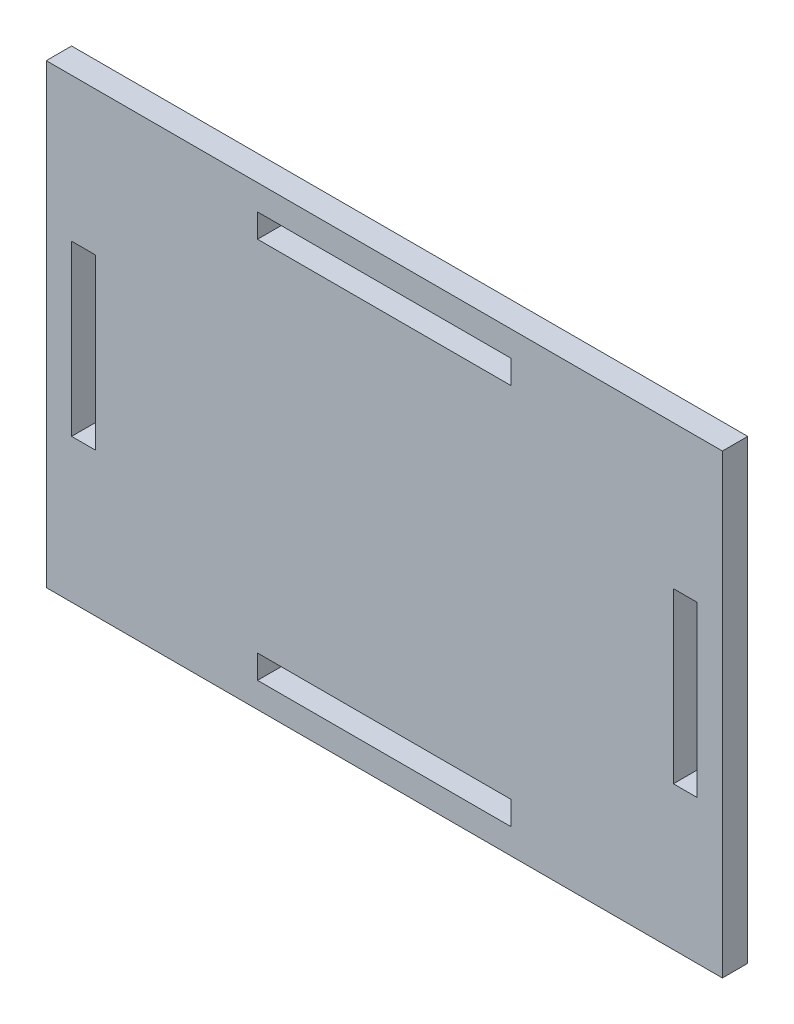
ISO-10303-21;
HEADER;
FILE_DESCRIPTION(('STEP AP214'),'2;1');
FILE_NAME('part.step','',(''),(''),'','','');
FILE_SCHEMA(('AUTOMOTIVE_DESIGN { 1 0 10303 214 1 1 1 1 }'));
ENDSEC;
DATA;
#1=APPLICATION_CONTEXT('core data for automotive mechanical design processes');
#2=APPLICATION_PROTOCOL_DEFINITION('international standard','automotive_design',2000,#1);
#3=PRODUCT_CONTEXT('',#1,'mechanical');
#4=PRODUCT('Part','Part','',(#3));
#5=PRODUCT_RELATED_PRODUCT_CATEGORY('part','',(#4));
#6=PRODUCT_DEFINITION_FORMATION('','',#4);
#7=PRODUCT_DEFINITION_CONTEXT('part definition',#1,'design');
#8=PRODUCT_DEFINITION('design','',#6,#7);
#9=PRODUCT_DEFINITION_SHAPE('','',#8);
#10=(LENGTH_UNIT() NAMED_UNIT(*) SI_UNIT(.MILLI.,.METRE.));
#11=(NAMED_UNIT(*) PLANE_ANGLE_UNIT() SI_UNIT($,.RADIAN.));
#12=(NAMED_UNIT(*) SI_UNIT($,.STERADIAN.) SOLID_ANGLE_UNIT());
#13=UNCERTAINTY_MEASURE_WITH_UNIT(LENGTH_MEASURE(1.E-05),#10,'distance_accuracy_value','');
#14=(GEOMETRIC_REPRESENTATION_CONTEXT(3) GLOBAL_UNCERTAINTY_ASSIGNED_CONTEXT((#13)) GLOBAL_UNIT_ASSIGNED_CONTEXT((#10,
#11,#12)) REPRESENTATION_CONTEXT('',''));
#15=CARTESIAN_POINT('',(0.,0.,0.));
#16=DIRECTION('',(0.,0.,1.));
#17=DIRECTION('',(1.,0.,0.));
#18=AXIS2_PLACEMENT_3D('',#15,#16,#17);
#19=CARTESIAN_POINT('',(0.,0.,3.));
#20=DIRECTION('',(0.,0.,-1.));
#21=DIRECTION('',(-1.,0.,0.));
#22=AXIS2_PLACEMENT_3D('',#19,#20,#21);
#23=PLANE('',#22);
#24=DIRECTION('',(0.,-1.,0.));
#25=VECTOR('',#24,1.);
#26=CARTESIAN_POINT('',(-15.,-24.,3.));
#27=LINE('',#26,#25);
#28=CARTESIAN_POINT('',(-15.,-21.2,3.));
#29=VERTEX_POINT('',#28);
#30=CARTESIAN_POINT('',(-15.,-24.,3.));
#31=VERTEX_POINT('',#30);
#32=EDGE_CURVE('E206',#29,#31,#27,.T.);
#33=ORIENTED_EDGE('',*,*,#32,.F.);
#34=DIRECTION('',(-1.,0.,0.));
#35=VECTOR('',#34,1.);
#36=CARTESIAN_POINT('',(-15.,-21.2,3.));
#37=LINE('',#36,#35);
#38=CARTESIAN_POINT('',(15.,-21.2,3.));
#39=VERTEX_POINT('',#38);
#40=EDGE_CURVE('E214',#39,#29,#37,.T.);
#41=ORIENTED_EDGE('',*,*,#40,.F.);
#42=DIRECTION('',(0.,1.,0.));
#43=VECTOR('',#42,1.);
#44=CARTESIAN_POINT('',(15.,-24.,3.));
#45=LINE('',#44,#43);
#46=CARTESIAN_POINT('',(15.,-24.,3.));
#47=VERTEX_POINT('',#46);
#48=EDGE_CURVE('E211',#47,#39,#45,.T.);
#49=ORIENTED_EDGE('',*,*,#48,.F.);
#50=DIRECTION('',(1.,0.,0.));
#51=VECTOR('',#50,1.);
#52=CARTESIAN_POINT('',(-15.,-24.,3.));
#53=LINE('',#52,#51);
#54=EDGE_CURVE('E208',#31,#47,#53,.T.);
#55=ORIENTED_EDGE('',*,*,#54,.F.);
#56=EDGE_LOOP('',(#33,#41,#49,#55));
#57=FACE_BOUND('',#56,.T.);
#58=DIRECTION('',(0.,1.,0.));
#59=VECTOR('',#58,1.);
#60=CARTESIAN_POINT('',(15.,24.,3.));
#61=LINE('',#60,#59);
#62=CARTESIAN_POINT('',(15.,21.2,3.));
#63=VERTEX_POINT('',#62);
#64=CARTESIAN_POINT('',(15.,24.,3.));
#65=VERTEX_POINT('',#64);
#66=EDGE_CURVE('E268',#63,#65,#61,.T.);
#67=ORIENTED_EDGE('',*,*,#66,.F.);
#68=DIRECTION('',(1.,0.,0.));
#69=VECTOR('',#68,1.);
#70=CARTESIAN_POINT('',(-15.,21.2,3.));
#71=LINE('',#70,#69);
#72=CARTESIAN_POINT('',(-15.,21.2,3.));
#73=VERTEX_POINT('',#72);
#74=EDGE_CURVE('E276',#73,#63,#71,.T.);
#75=ORIENTED_EDGE('',*,*,#74,.F.);
#76=DIRECTION('',(0.,-1.,0.));
#77=VECTOR('',#76,1.);
#78=CARTESIAN_POINT('',(-15.,24.,3.));
#79=LINE('',#78,#77);
#80=CARTESIAN_POINT('',(-15.,24.,3.));
#81=VERTEX_POINT('',#80);
#82=EDGE_CURVE('E273',#81,#73,#79,.T.);
#83=ORIENTED_EDGE('',*,*,#82,.F.);
#84=DIRECTION('',(-1.,0.,0.));
#85=VECTOR('',#84,1.);
#86=CARTESIAN_POINT('',(-15.,24.,3.));
#87=LINE('',#86,#85);
#88=EDGE_CURVE('E270',#65,#81,#87,.T.);
#89=ORIENTED_EDGE('',*,*,#88,.F.);
#90=EDGE_LOOP('',(#67,#75,#83,#89));
#91=FACE_BOUND('',#90,.T.);
#92=DIRECTION('',(0.,1.,0.));
#93=VECTOR('',#92,1.);
#94=CARTESIAN_POINT('',(40.,-27.,3.));
#95=LINE('',#94,#93);
#96=CARTESIAN_POINT('',(40.,-27.,3.));
#97=VERTEX_POINT('',#96);
#98=CARTESIAN_POINT('',(40.,27.,3.));
#99=VERTEX_POINT('',#98);
#100=EDGE_CURVE('E299',#97,#99,#95,.T.);
#101=ORIENTED_EDGE('',*,*,#100,.T.);
#102=DIRECTION('',(-1.,0.,0.));
#103=VECTOR('',#102,1.);
#104=CARTESIAN_POINT('',(-40.,27.,3.));
#105=LINE('',#104,#103);
#106=CARTESIAN_POINT('',(-40.,27.,3.));
#107=VERTEX_POINT('',#106);
#108=EDGE_CURVE('E302',#99,#107,#105,.T.);
#109=ORIENTED_EDGE('',*,*,#108,.T.);
#110=DIRECTION('',(0.,-1.,0.));
#111=VECTOR('',#110,1.);
#112=CARTESIAN_POINT('',(-40.,-27.,3.));
#113=LINE('',#112,#111);
#114=CARTESIAN_POINT('',(-40.,-27.,3.));
#115=VERTEX_POINT('',#114);
#116=EDGE_CURVE('E305',#107,#115,#113,.T.);
#117=ORIENTED_EDGE('',*,*,#116,.T.);
#118=DIRECTION('',(1.,0.,0.));
#119=VECTOR('',#118,1.);
#120=CARTESIAN_POINT('',(-40.,-27.,3.));
#121=LINE('',#120,#119);
#122=EDGE_CURVE('E307',#115,#97,#121,.T.);
#123=ORIENTED_EDGE('',*,*,#122,.T.);
#124=EDGE_LOOP('',(#101,#109,#117,#123));
#125=FACE_BOUND('',#124,.T.);
#126=DIRECTION('',(0.,1.,0.));
#127=VECTOR('',#126,1.);
#128=CARTESIAN_POINT('',(-34.2,-10.,3.));
#129=LINE('',#128,#127);
#130=CARTESIAN_POINT('',(-34.2,-10.,3.));
#131=VERTEX_POINT('',#130);
#132=CARTESIAN_POINT('',(-34.2,10.,3.));
#133=VERTEX_POINT('',#132);
#134=EDGE_CURVE('E237',#131,#133,#129,.T.);
#135=ORIENTED_EDGE('',*,*,#134,.F.);
#136=DIRECTION('',(1.,0.,0.));
#137=VECTOR('',#136,1.);
#138=CARTESIAN_POINT('',(-37.,-10.,3.));
#139=LINE('',#138,#137);
#140=CARTESIAN_POINT('',(-37.,-10.,3.));
#141=VERTEX_POINT('',#140);
#142=EDGE_CURVE('E245',#141,#131,#139,.T.);
#143=ORIENTED_EDGE('',*,*,#142,.F.);
#144=DIRECTION('',(0.,-1.,0.));
#145=VECTOR('',#144,1.);
#146=CARTESIAN_POINT('',(-37.,-10.,3.));
#147=LINE('',#146,#145);
#148=CARTESIAN_POINT('',(-37.,10.,3.));
#149=VERTEX_POINT('',#148);
#150=EDGE_CURVE('E242',#149,#141,#147,.T.);
#151=ORIENTED_EDGE('',*,*,#150,.F.);
#152=DIRECTION('',(-1.,0.,0.));
#153=VECTOR('',#152,1.);
#154=CARTESIAN_POINT('',(-37.,10.,3.));
#155=LINE('',#154,#153);
#156=EDGE_CURVE('E239',#133,#149,#155,.T.);
#157=ORIENTED_EDGE('',*,*,#156,.F.);
#158=EDGE_LOOP('',(#135,#143,#151,#157));
#159=FACE_BOUND('',#158,.T.);
#160=DIRECTION('',(0.,1.,0.));
#161=VECTOR('',#160,1.);
#162=CARTESIAN_POINT('',(37.,-9.99999999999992,3.));
#163=LINE('',#162,#161);
#164=CARTESIAN_POINT('',(37.,-9.99999999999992,3.));
#165=VERTEX_POINT('',#164);
#166=CARTESIAN_POINT('',(37.,10.0000000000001,3.));
#167=VERTEX_POINT('',#166);
#168=EDGE_CURVE('E170',#165,#167,#163,.T.);
#169=ORIENTED_EDGE('',*,*,#168,.F.);
#170=DIRECTION('',(1.,0.,0.));
#171=VECTOR('',#170,1.);
#172=CARTESIAN_POINT('',(37.,-9.99999999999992,3.));
#173=LINE('',#172,#171);
#174=CARTESIAN_POINT('',(34.2,-9.99999999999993,3.));
#175=VERTEX_POINT('',#174);
#176=EDGE_CURVE('E192',#175,#165,#173,.T.);
#177=ORIENTED_EDGE('',*,*,#176,.F.);
#178=DIRECTION('',(0.,-1.,0.));
#179=VECTOR('',#178,1.);
#180=CARTESIAN_POINT('',(34.2,-9.99999999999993,3.));
#181=LINE('',#180,#179);
#182=CARTESIAN_POINT('',(34.2,10.0000000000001,3.));
#183=VERTEX_POINT('',#182);
#184=EDGE_CURVE('E190',#183,#175,#181,.T.);
#185=ORIENTED_EDGE('',*,*,#184,.F.);
#186=DIRECTION('',(-1.,0.,0.));
#187=VECTOR('',#186,1.);
#188=CARTESIAN_POINT('',(37.,10.0000000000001,3.));
#189=LINE('',#188,#187);
#190=EDGE_CURVE('E178',#167,#183,#189,.T.);
#191=ORIENTED_EDGE('',*,*,#190,.F.);
#192=EDGE_LOOP('',(#169,#177,#185,#191));
#193=FACE_BOUND('',#192,.T.);
#194=ADVANCED_FACE('F33',(#57,#91,#125,#159,#193),#23,.F.);
#195=CARTESIAN_POINT('',(0.,0.,0.));
#196=DIRECTION('',(0.,0.,-1.));
#197=DIRECTION('',(-1.,0.,0.));
#198=AXIS2_PLACEMENT_3D('',#195,#196,#197);
#199=PLANE('',#198);
#200=DIRECTION('',(0.,1.,0.));
#201=VECTOR('',#200,1.);
#202=CARTESIAN_POINT('',(40.,-27.,0.));
#203=LINE('',#202,#201);
#204=CARTESIAN_POINT('',(40.,-27.,0.));
#205=VERTEX_POINT('',#204);
#206=CARTESIAN_POINT('',(40.,27.,0.));
#207=VERTEX_POINT('',#206);
#208=EDGE_CURVE('E298',#205,#207,#203,.T.);
#209=ORIENTED_EDGE('',*,*,#208,.F.);
#210=DIRECTION('',(1.,0.,0.));
#211=VECTOR('',#210,1.);
#212=CARTESIAN_POINT('',(-40.,-27.,0.));
#213=LINE('',#212,#211);
#214=CARTESIAN_POINT('',(-40.,-27.,0.));
#215=VERTEX_POINT('',#214);
#216=EDGE_CURVE('E303',#215,#205,#213,.T.);
#217=ORIENTED_EDGE('',*,*,#216,.F.);
#218=DIRECTION('',(0.,-1.,0.));
#219=VECTOR('',#218,1.);
#220=CARTESIAN_POINT('',(-40.,-27.,0.));
#221=LINE('',#220,#219);
#222=CARTESIAN_POINT('',(-40.,27.,0.));
#223=VERTEX_POINT('',#222);
#224=EDGE_CURVE('E314',#223,#215,#221,.T.);
#225=ORIENTED_EDGE('',*,*,#224,.F.);
#226=DIRECTION('',(-1.,0.,0.));
#227=VECTOR('',#226,1.);
#228=CARTESIAN_POINT('',(-40.,27.,0.));
#229=LINE('',#228,#227);
#230=EDGE_CURVE('E312',#207,#223,#229,.T.);
#231=ORIENTED_EDGE('',*,*,#230,.F.);
#232=EDGE_LOOP('',(#209,#217,#225,#231));
#233=FACE_BOUND('',#232,.T.);
#234=DIRECTION('',(1.,0.,0.));
#235=VECTOR('',#234,1.);
#236=CARTESIAN_POINT('',(-15.,21.2,0.));
#237=LINE('',#236,#235);
#238=CARTESIAN_POINT('',(-15.,21.2,0.));
#239=VERTEX_POINT('',#238);
#240=CARTESIAN_POINT('',(15.,21.2,0.));
#241=VERTEX_POINT('',#240);
#242=EDGE_CURVE('E271',#239,#241,#237,.T.);
#243=ORIENTED_EDGE('',*,*,#242,.T.);
#244=DIRECTION('',(0.,1.,0.));
#245=VECTOR('',#244,1.);
#246=CARTESIAN_POINT('',(15.,24.,0.));
#247=LINE('',#246,#245);
#248=CARTESIAN_POINT('',(15.,24.,0.));
#249=VERTEX_POINT('',#248);
#250=EDGE_CURVE('E267',#241,#249,#247,.T.);
#251=ORIENTED_EDGE('',*,*,#250,.T.);
#252=DIRECTION('',(-1.,0.,0.));
#253=VECTOR('',#252,1.);
#254=CARTESIAN_POINT('',(-15.,24.,0.));
#255=LINE('',#254,#253);
#256=CARTESIAN_POINT('',(-15.,24.,0.));
#257=VERTEX_POINT('',#256);
#258=EDGE_CURVE('E281',#249,#257,#255,.T.);
#259=ORIENTED_EDGE('',*,*,#258,.T.);
#260=DIRECTION('',(0.,-1.,0.));
#261=VECTOR('',#260,1.);
#262=CARTESIAN_POINT('',(-15.,24.,0.));
#263=LINE('',#262,#261);
#264=EDGE_CURVE('E284',#257,#239,#263,.T.);
#265=ORIENTED_EDGE('',*,*,#264,.T.);
#266=EDGE_LOOP('',(#243,#251,#259,#265));
#267=FACE_BOUND('',#266,.T.);
#268=DIRECTION('',(1.,0.,0.));
#269=VECTOR('',#268,1.);
#270=CARTESIAN_POINT('',(-37.,-10.,0.));
#271=LINE('',#270,#269);
#272=CARTESIAN_POINT('',(-37.,-10.,0.));
#273=VERTEX_POINT('',#272);
#274=CARTESIAN_POINT('',(-34.2,-10.,0.));
#275=VERTEX_POINT('',#274);
#276=EDGE_CURVE('E240',#273,#275,#271,.T.);
#277=ORIENTED_EDGE('',*,*,#276,.T.);
#278=DIRECTION('',(0.,1.,0.));
#279=VECTOR('',#278,1.);
#280=CARTESIAN_POINT('',(-34.2,-10.,0.));
#281=LINE('',#280,#279);
#282=CARTESIAN_POINT('',(-34.2,10.,0.));
#283=VERTEX_POINT('',#282);
#284=EDGE_CURVE('E236',#275,#283,#281,.T.);
#285=ORIENTED_EDGE('',*,*,#284,.T.);
#286=DIRECTION('',(-1.,0.,0.));
#287=VECTOR('',#286,1.);
#288=CARTESIAN_POINT('',(-37.,10.,0.));
#289=LINE('',#288,#287);
#290=CARTESIAN_POINT('',(-37.,10.,0.));
#291=VERTEX_POINT('',#290);
#292=EDGE_CURVE('E250',#283,#291,#289,.T.);
#293=ORIENTED_EDGE('',*,*,#292,.T.);
#294=DIRECTION('',(0.,-1.,0.));
#295=VECTOR('',#294,1.);
#296=CARTESIAN_POINT('',(-37.,-10.,0.));
#297=LINE('',#296,#295);
#298=EDGE_CURVE('E253',#291,#273,#297,.T.);
#299=ORIENTED_EDGE('',*,*,#298,.T.);
#300=EDGE_LOOP('',(#277,#285,#293,#299));
#301=FACE_BOUND('',#300,.T.);
#302=DIRECTION('',(-1.,0.,0.));
#303=VECTOR('',#302,1.);
#304=CARTESIAN_POINT('',(-15.,-21.2,0.));
#305=LINE('',#304,#303);
#306=CARTESIAN_POINT('',(15.,-21.2,0.));
#307=VERTEX_POINT('',#306);
#308=CARTESIAN_POINT('',(-15.,-21.2,0.));
#309=VERTEX_POINT('',#308);
#310=EDGE_CURVE('E209',#307,#309,#305,.T.);
#311=ORIENTED_EDGE('',*,*,#310,.T.);
#312=DIRECTION('',(0.,-1.,0.));
#313=VECTOR('',#312,1.);
#314=CARTESIAN_POINT('',(-15.,-24.,0.));
#315=LINE('',#314,#313);
#316=CARTESIAN_POINT('',(-15.,-24.,0.));
#317=VERTEX_POINT('',#316);
#318=EDGE_CURVE('E186',#309,#317,#315,.T.);
#319=ORIENTED_EDGE('',*,*,#318,.T.);
#320=DIRECTION('',(1.,0.,0.));
#321=VECTOR('',#320,1.);
#322=CARTESIAN_POINT('',(-15.,-24.,0.));
#323=LINE('',#322,#321);
#324=CARTESIAN_POINT('',(15.,-24.,0.));
#325=VERTEX_POINT('',#324);
#326=EDGE_CURVE('E219',#317,#325,#323,.T.);
#327=ORIENTED_EDGE('',*,*,#326,.T.);
#328=DIRECTION('',(0.,1.,0.));
#329=VECTOR('',#328,1.);
#330=CARTESIAN_POINT('',(15.,-24.,0.));
#331=LINE('',#330,#329);
#332=EDGE_CURVE('E222',#325,#307,#331,.T.);
#333=ORIENTED_EDGE('',*,*,#332,.T.);
#334=EDGE_LOOP('',(#311,#319,#327,#333));
#335=FACE_BOUND('',#334,.T.);
#336=DIRECTION('',(1.,0.,0.));
#337=VECTOR('',#336,1.);
#338=CARTESIAN_POINT('',(37.,-9.99999999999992,0.));
#339=LINE('',#338,#337);
#340=CARTESIAN_POINT('',(34.2,-9.99999999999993,0.));
#341=VERTEX_POINT('',#340);
#342=CARTESIAN_POINT('',(37.,-9.99999999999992,0.));
#343=VERTEX_POINT('',#342);
#344=EDGE_CURVE('E179',#341,#343,#339,.T.);
#345=ORIENTED_EDGE('',*,*,#344,.T.);
#346=DIRECTION('',(0.,1.,0.));
#347=VECTOR('',#346,1.);
#348=CARTESIAN_POINT('',(37.,-9.99999999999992,0.));
#349=LINE('',#348,#347);
#350=CARTESIAN_POINT('',(37.,10.0000000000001,0.));
#351=VERTEX_POINT('',#350);
#352=EDGE_CURVE('E56',#343,#351,#349,.T.);
#353=ORIENTED_EDGE('',*,*,#352,.T.);
#354=DIRECTION('',(-1.,0.,0.));
#355=VECTOR('',#354,1.);
#356=CARTESIAN_POINT('',(37.,10.0000000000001,0.));
#357=LINE('',#356,#355);
#358=CARTESIAN_POINT('',(34.2,10.0000000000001,0.));
#359=VERTEX_POINT('',#358);
#360=EDGE_CURVE('E185',#351,#359,#357,.T.);
#361=ORIENTED_EDGE('',*,*,#360,.T.);
#362=DIRECTION('',(0.,-1.,0.));
#363=VECTOR('',#362,1.);
#364=CARTESIAN_POINT('',(34.2,-9.99999999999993,0.));
#365=LINE('',#364,#363);
#366=EDGE_CURVE('E198',#359,#341,#365,.T.);
#367=ORIENTED_EDGE('',*,*,#366,.T.);
#368=EDGE_LOOP('',(#345,#353,#361,#367));
#369=FACE_BOUND('',#368,.T.);
#370=ADVANCED_FACE('F332',(#233,#267,#301,#335,#369),#199,.T.);
#371=CARTESIAN_POINT('',(40.,-27.,3.));
#372=DIRECTION('',(-1.,0.,0.));
#373=DIRECTION('',(0.,0.,1.));
#374=AXIS2_PLACEMENT_3D('',#371,#372,#373);
#375=PLANE('',#374);
#376=ORIENTED_EDGE('',*,*,#208,.T.);
#377=DIRECTION('',(0.,0.,-1.));
#378=VECTOR('',#377,1.);
#379=CARTESIAN_POINT('',(40.,27.,3.));
#380=LINE('',#379,#378);
#381=EDGE_CURVE('E11',#99,#207,#380,.T.);
#382=ORIENTED_EDGE('',*,*,#381,.F.);
#383=ORIENTED_EDGE('',*,*,#100,.F.);
#384=DIRECTION('',(0.,0.,-1.));
#385=VECTOR('',#384,1.);
#386=CARTESIAN_POINT('',(40.,-27.,3.));
#387=LINE('',#386,#385);
#388=EDGE_CURVE('E309',#97,#205,#387,.T.);
#389=ORIENTED_EDGE('',*,*,#388,.T.);
#390=EDGE_LOOP('',(#376,#382,#383,#389));
#391=FACE_BOUND('',#390,.T.);
#392=ADVANCED_FACE('F35',(#391),#375,.F.);
#393=CARTESIAN_POINT('',(-40.,27.,3.));
#394=DIRECTION('',(0.,-1.,0.));
#395=DIRECTION('',(0.,0.,-1.));
#396=AXIS2_PLACEMENT_3D('',#393,#394,#395);
#397=PLANE('',#396);
#398=ORIENTED_EDGE('',*,*,#230,.T.);
#399=DIRECTION('',(0.,0.,-1.));
#400=VECTOR('',#399,1.);
#401=CARTESIAN_POINT('',(-40.,27.,3.));
#402=LINE('',#401,#400);
#403=EDGE_CURVE('E41',#107,#223,#402,.T.);
#404=ORIENTED_EDGE('',*,*,#403,.F.);
#405=ORIENTED_EDGE('',*,*,#108,.F.);
#406=ORIENTED_EDGE('',*,*,#381,.T.);
#407=EDGE_LOOP('',(#398,#404,#405,#406));
#408=FACE_BOUND('',#407,.T.);
#409=ADVANCED_FACE('F343',(#408),#397,.F.);
#410=CARTESIAN_POINT('',(-40.,-27.,3.));
#411=DIRECTION('',(1.,0.,0.));
#412=DIRECTION('',(0.,0.,-1.));
#413=AXIS2_PLACEMENT_3D('',#410,#411,#412);
#414=PLANE('',#413);
#415=ORIENTED_EDGE('',*,*,#224,.T.);
#416=DIRECTION('',(0.,0.,-1.));
#417=VECTOR('',#416,1.);
#418=CARTESIAN_POINT('',(-40.,-27.,3.));
#419=LINE('',#418,#417);
#420=EDGE_CURVE('E319',#115,#215,#419,.T.);
#421=ORIENTED_EDGE('',*,*,#420,.F.);
#422=ORIENTED_EDGE('',*,*,#116,.F.);
#423=ORIENTED_EDGE('',*,*,#403,.T.);
#424=EDGE_LOOP('',(#415,#421,#422,#423));
#425=FACE_BOUND('',#424,.T.);
#426=ADVANCED_FACE('F326',(#425),#414,.F.);
#427=CARTESIAN_POINT('',(-40.,-27.,3.));
#428=DIRECTION('',(0.,1.,0.));
#429=DIRECTION('',(0.,0.,1.));
#430=AXIS2_PLACEMENT_3D('',#427,#428,#429);
#431=PLANE('',#430);
#432=ORIENTED_EDGE('',*,*,#216,.T.);
#433=ORIENTED_EDGE('',*,*,#388,.F.);
#434=ORIENTED_EDGE('',*,*,#122,.F.);
#435=ORIENTED_EDGE('',*,*,#420,.T.);
#436=EDGE_LOOP('',(#432,#433,#434,#435));
#437=FACE_BOUND('',#436,.T.);
#438=ADVANCED_FACE('F336',(#437),#431,.F.);
#439=CARTESIAN_POINT('',(15.,24.,3.));
#440=DIRECTION('',(-1.,0.,0.));
#441=DIRECTION('',(0.,0.,1.));
#442=AXIS2_PLACEMENT_3D('',#439,#440,#441);
#443=PLANE('',#442);
#444=ORIENTED_EDGE('',*,*,#250,.F.);
#445=DIRECTION('',(0.,0.,-1.));
#446=VECTOR('',#445,1.);
#447=CARTESIAN_POINT('',(15.,21.2,3.));
#448=LINE('',#447,#446);
#449=EDGE_CURVE('E278',#63,#241,#448,.T.);
#450=ORIENTED_EDGE('',*,*,#449,.F.);
#451=ORIENTED_EDGE('',*,*,#66,.T.);
#452=DIRECTION('',(0.,0.,-1.));
#453=VECTOR('',#452,1.);
#454=CARTESIAN_POINT('',(15.,24.,3.));
#455=LINE('',#454,#453);
#456=EDGE_CURVE('E295',#65,#249,#455,.T.);
#457=ORIENTED_EDGE('',*,*,#456,.T.);
#458=EDGE_LOOP('',(#444,#450,#451,#457));
#459=FACE_BOUND('',#458,.T.);
#460=ADVANCED_FACE('F360',(#459),#443,.T.);
#461=CARTESIAN_POINT('',(-15.,24.,3.));
#462=DIRECTION('',(0.,-1.,0.));
#463=DIRECTION('',(0.,0.,-1.));
#464=AXIS2_PLACEMENT_3D('',#461,#462,#463);
#465=PLANE('',#464);
#466=ORIENTED_EDGE('',*,*,#258,.F.);
#467=ORIENTED_EDGE('',*,*,#456,.F.);
#468=ORIENTED_EDGE('',*,*,#88,.T.);
#469=DIRECTION('',(0.,0.,-1.));
#470=VECTOR('',#469,1.);
#471=CARTESIAN_POINT('',(-15.,24.,3.));
#472=LINE('',#471,#470);
#473=EDGE_CURVE('E293',#81,#257,#472,.T.);
#474=ORIENTED_EDGE('',*,*,#473,.T.);
#475=EDGE_LOOP('',(#466,#467,#468,#474));
#476=FACE_BOUND('',#475,.T.);
#477=ADVANCED_FACE('F367',(#476),#465,.T.);
#478=CARTESIAN_POINT('',(-15.,24.,3.));
#479=DIRECTION('',(1.,0.,0.));
#480=DIRECTION('',(0.,0.,-1.));
#481=AXIS2_PLACEMENT_3D('',#478,#479,#480);
#482=PLANE('',#481);
#483=ORIENTED_EDGE('',*,*,#264,.F.);
#484=ORIENTED_EDGE('',*,*,#473,.F.);
#485=ORIENTED_EDGE('',*,*,#82,.T.);
#486=DIRECTION('',(0.,0.,-1.));
#487=VECTOR('',#486,1.);
#488=CARTESIAN_POINT('',(-15.,21.2,3.));
#489=LINE('',#488,#487);
#490=EDGE_CURVE('E291',#73,#239,#489,.T.);
#491=ORIENTED_EDGE('',*,*,#490,.T.);
#492=EDGE_LOOP('',(#483,#484,#485,#491));
#493=FACE_BOUND('',#492,.T.);
#494=ADVANCED_FACE('F372',(#493),#482,.T.);
#495=CARTESIAN_POINT('',(-15.,21.2,3.));
#496=DIRECTION('',(0.,1.,0.));
#497=DIRECTION('',(0.,0.,1.));
#498=AXIS2_PLACEMENT_3D('',#495,#496,#497);
#499=PLANE('',#498);
#500=ORIENTED_EDGE('',*,*,#242,.F.);
#501=ORIENTED_EDGE('',*,*,#490,.F.);
#502=ORIENTED_EDGE('',*,*,#74,.T.);
#503=ORIENTED_EDGE('',*,*,#449,.T.);
#504=EDGE_LOOP('',(#500,#501,#502,#503));
#505=FACE_BOUND('',#504,.T.);
#506=ADVANCED_FACE('F379',(#505),#499,.T.);
#507=CARTESIAN_POINT('',(-34.2,-10.,3.));
#508=DIRECTION('',(-1.,0.,0.));
#509=DIRECTION('',(0.,0.,1.));
#510=AXIS2_PLACEMENT_3D('',#507,#508,#509);
#511=PLANE('',#510);
#512=ORIENTED_EDGE('',*,*,#284,.F.);
#513=DIRECTION('',(0.,0.,-1.));
#514=VECTOR('',#513,1.);
#515=CARTESIAN_POINT('',(-34.2,-10.,3.));
#516=LINE('',#515,#514);
#517=EDGE_CURVE('E247',#131,#275,#516,.T.);
#518=ORIENTED_EDGE('',*,*,#517,.F.);
#519=ORIENTED_EDGE('',*,*,#134,.T.);
#520=DIRECTION('',(0.,0.,-1.));
#521=VECTOR('',#520,1.);
#522=CARTESIAN_POINT('',(-34.2,10.,3.));
#523=LINE('',#522,#521);
#524=EDGE_CURVE('E264',#133,#283,#523,.T.);
#525=ORIENTED_EDGE('',*,*,#524,.T.);
#526=EDGE_LOOP('',(#512,#518,#519,#525));
#527=FACE_BOUND('',#526,.T.);
#528=ADVANCED_FACE('F392',(#527),#511,.T.);
#529=CARTESIAN_POINT('',(-37.,10.,3.));
#530=DIRECTION('',(0.,-1.,0.));
#531=DIRECTION('',(0.,0.,-1.));
#532=AXIS2_PLACEMENT_3D('',#529,#530,#531);
#533=PLANE('',#532);
#534=ORIENTED_EDGE('',*,*,#292,.F.);
#535=ORIENTED_EDGE('',*,*,#524,.F.);
#536=ORIENTED_EDGE('',*,*,#156,.T.);
#537=DIRECTION('',(0.,0.,-1.));
#538=VECTOR('',#537,1.);
#539=CARTESIAN_POINT('',(-37.,10.,3.));
#540=LINE('',#539,#538);
#541=EDGE_CURVE('E262',#149,#291,#540,.T.);
#542=ORIENTED_EDGE('',*,*,#541,.T.);
#543=EDGE_LOOP('',(#534,#535,#536,#542));
#544=FACE_BOUND('',#543,.T.);
#545=ADVANCED_FACE('F397',(#544),#533,.T.);
#546=CARTESIAN_POINT('',(-37.,-10.,3.));
#547=DIRECTION('',(1.,0.,0.));
#548=DIRECTION('',(0.,0.,-1.));
#549=AXIS2_PLACEMENT_3D('',#546,#547,#548);
#550=PLANE('',#549);
#551=ORIENTED_EDGE('',*,*,#298,.F.);
#552=ORIENTED_EDGE('',*,*,#541,.F.);
#553=ORIENTED_EDGE('',*,*,#150,.T.);
#554=DIRECTION('',(0.,0.,-1.));
#555=VECTOR('',#554,1.);
#556=CARTESIAN_POINT('',(-37.,-10.,3.));
#557=LINE('',#556,#555);
#558=EDGE_CURVE('E260',#141,#273,#557,.T.);
#559=ORIENTED_EDGE('',*,*,#558,.T.);
#560=EDGE_LOOP('',(#551,#552,#553,#559));
#561=FACE_BOUND('',#560,.T.);
#562=ADVANCED_FACE('F401',(#561),#550,.T.);
#563=CARTESIAN_POINT('',(-37.,-10.,3.));
#564=DIRECTION('',(0.,1.,0.));
#565=DIRECTION('',(0.,0.,1.));
#566=AXIS2_PLACEMENT_3D('',#563,#564,#565);
#567=PLANE('',#566);
#568=ORIENTED_EDGE('',*,*,#276,.F.);
#569=ORIENTED_EDGE('',*,*,#558,.F.);
#570=ORIENTED_EDGE('',*,*,#142,.T.);
#571=ORIENTED_EDGE('',*,*,#517,.T.);
#572=EDGE_LOOP('',(#568,#569,#570,#571));
#573=FACE_BOUND('',#572,.T.);
#574=ADVANCED_FACE('F405',(#573),#567,.T.);
#575=CARTESIAN_POINT('',(-15.,-24.,3.));
#576=DIRECTION('',(1.,0.,0.));
#577=DIRECTION('',(0.,0.,-1.));
#578=AXIS2_PLACEMENT_3D('',#575,#576,#577);
#579=PLANE('',#578);
#580=ORIENTED_EDGE('',*,*,#318,.F.);
#581=DIRECTION('',(0.,0.,-1.));
#582=VECTOR('',#581,1.);
#583=CARTESIAN_POINT('',(-15.,-21.2,3.));
#584=LINE('',#583,#582);
#585=EDGE_CURVE('E216',#29,#309,#584,.T.);
#586=ORIENTED_EDGE('',*,*,#585,.F.);
#587=ORIENTED_EDGE('',*,*,#32,.T.);
#588=DIRECTION('',(0.,0.,-1.));
#589=VECTOR('',#588,1.);
#590=CARTESIAN_POINT('',(-15.,-24.,3.));
#591=LINE('',#590,#589);
#592=EDGE_CURVE('E233',#31,#317,#591,.T.);
#593=ORIENTED_EDGE('',*,*,#592,.T.);
#594=EDGE_LOOP('',(#580,#586,#587,#593));
#595=FACE_BOUND('',#594,.T.);
#596=ADVANCED_FACE('F409',(#595),#579,.T.);
#597=CARTESIAN_POINT('',(-15.,-24.,3.));
#598=DIRECTION('',(0.,1.,0.));
#599=DIRECTION('',(0.,0.,1.));
#600=AXIS2_PLACEMENT_3D('',#597,#598,#599);
#601=PLANE('',#600);
#602=ORIENTED_EDGE('',*,*,#326,.F.);
#603=ORIENTED_EDGE('',*,*,#592,.F.);
#604=ORIENTED_EDGE('',*,*,#54,.T.);
#605=DIRECTION('',(0.,0.,-1.));
#606=VECTOR('',#605,1.);
#607=CARTESIAN_POINT('',(15.,-24.,3.));
#608=LINE('',#607,#606);
#609=EDGE_CURVE('E231',#47,#325,#608,.T.);
#610=ORIENTED_EDGE('',*,*,#609,.T.);
#611=EDGE_LOOP('',(#602,#603,#604,#610));
#612=FACE_BOUND('',#611,.T.);
#613=ADVANCED_FACE('F413',(#612),#601,.T.);
#614=CARTESIAN_POINT('',(15.,-24.,3.));
#615=DIRECTION('',(-1.,0.,0.));
#616=DIRECTION('',(0.,0.,1.));
#617=AXIS2_PLACEMENT_3D('',#614,#615,#616);
#618=PLANE('',#617);
#619=ORIENTED_EDGE('',*,*,#332,.F.);
#620=ORIENTED_EDGE('',*,*,#609,.F.);
#621=ORIENTED_EDGE('',*,*,#48,.T.);
#622=DIRECTION('',(0.,0.,-1.));
#623=VECTOR('',#622,1.);
#624=CARTESIAN_POINT('',(15.,-21.2,3.));
#625=LINE('',#624,#623);
#626=EDGE_CURVE('E229',#39,#307,#625,.T.);
#627=ORIENTED_EDGE('',*,*,#626,.T.);
#628=EDGE_LOOP('',(#619,#620,#621,#627));
#629=FACE_BOUND('',#628,.T.);
#630=ADVANCED_FACE('F417',(#629),#618,.T.);
#631=CARTESIAN_POINT('',(-15.,-21.2,3.));
#632=DIRECTION('',(0.,-1.,0.));
#633=DIRECTION('',(0.,0.,-1.));
#634=AXIS2_PLACEMENT_3D('',#631,#632,#633);
#635=PLANE('',#634);
#636=ORIENTED_EDGE('',*,*,#310,.F.);
#637=ORIENTED_EDGE('',*,*,#626,.F.);
#638=ORIENTED_EDGE('',*,*,#40,.T.);
#639=ORIENTED_EDGE('',*,*,#585,.T.);
#640=EDGE_LOOP('',(#636,#637,#638,#639));
#641=FACE_BOUND('',#640,.T.);
#642=ADVANCED_FACE('F421',(#641),#635,.T.);
#643=CARTESIAN_POINT('',(37.,-9.99999999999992,3.));
#644=DIRECTION('',(-1.,0.,0.));
#645=DIRECTION('',(0.,-1.,0.));
#646=AXIS2_PLACEMENT_3D('',#643,#644,#645);
#647=PLANE('',#646);
#648=ORIENTED_EDGE('',*,*,#352,.F.);
#649=DIRECTION('',(0.,0.,-1.));
#650=VECTOR('',#649,1.);
#651=CARTESIAN_POINT('',(37.,-9.99999999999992,3.));
#652=LINE('',#651,#650);
#653=EDGE_CURVE('E174',#165,#343,#652,.T.);
#654=ORIENTED_EDGE('',*,*,#653,.F.);
#655=ORIENTED_EDGE('',*,*,#168,.T.);
#656=DIRECTION('',(0.,0.,-1.));
#657=VECTOR('',#656,1.);
#658=CARTESIAN_POINT('',(37.,10.0000000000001,3.));
#659=LINE('',#658,#657);
#660=EDGE_CURVE('E173',#167,#351,#659,.T.);
#661=ORIENTED_EDGE('',*,*,#660,.T.);
#662=EDGE_LOOP('',(#648,#654,#655,#661));
#663=FACE_BOUND('',#662,.T.);
#664=ADVANCED_FACE('F172',(#663),#647,.T.);
#665=CARTESIAN_POINT('',(37.,10.0000000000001,3.));
#666=DIRECTION('',(0.,-1.,0.));
#667=DIRECTION('',(1.,0.,0.));
#668=AXIS2_PLACEMENT_3D('',#665,#666,#667);
#669=PLANE('',#668);
#670=ORIENTED_EDGE('',*,*,#360,.F.);
#671=ORIENTED_EDGE('',*,*,#660,.F.);
#672=ORIENTED_EDGE('',*,*,#190,.T.);
#673=DIRECTION('',(0.,0.,-1.));
#674=VECTOR('',#673,1.);
#675=CARTESIAN_POINT('',(34.2,10.0000000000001,3.));
#676=LINE('',#675,#674);
#677=EDGE_CURVE('E187',#183,#359,#676,.T.);
#678=ORIENTED_EDGE('',*,*,#677,.T.);
#679=EDGE_LOOP('',(#670,#671,#672,#678));
#680=FACE_BOUND('',#679,.T.);
#681=ADVANCED_FACE('F182',(#680),#669,.T.);
#682=CARTESIAN_POINT('',(34.2,-9.99999999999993,3.));
#683=DIRECTION('',(1.,0.,0.));
#684=DIRECTION('',(0.,1.,0.));
#685=AXIS2_PLACEMENT_3D('',#682,#683,#684);
#686=PLANE('',#685);
#687=ORIENTED_EDGE('',*,*,#366,.F.);
#688=ORIENTED_EDGE('',*,*,#677,.F.);
#689=ORIENTED_EDGE('',*,*,#184,.T.);
#690=DIRECTION('',(0.,0.,-1.));
#691=VECTOR('',#690,1.);
#692=CARTESIAN_POINT('',(34.2,-9.99999999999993,3.));
#693=LINE('',#692,#691);
#694=EDGE_CURVE('E48',#175,#341,#693,.T.);
#695=ORIENTED_EDGE('',*,*,#694,.T.);
#696=EDGE_LOOP('',(#687,#688,#689,#695));
#697=FACE_BOUND('',#696,.T.);
#698=ADVANCED_FACE('F430',(#697),#686,.T.);
#699=CARTESIAN_POINT('',(37.,-9.99999999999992,3.));
#700=DIRECTION('',(0.,1.,0.));
#701=DIRECTION('',(-1.,0.,0.));
#702=AXIS2_PLACEMENT_3D('',#699,#700,#701);
#703=PLANE('',#702);
#704=ORIENTED_EDGE('',*,*,#344,.F.);
#705=ORIENTED_EDGE('',*,*,#694,.F.);
#706=ORIENTED_EDGE('',*,*,#176,.T.);
#707=ORIENTED_EDGE('',*,*,#653,.T.);
#708=EDGE_LOOP('',(#704,#705,#706,#707));
#709=FACE_BOUND('',#708,.T.);
#710=ADVANCED_FACE('F433',(#709),#703,.T.);
#711=CLOSED_SHELL('',(#194,#370,#392,#409,#426,#438,#460,#477,#494,#506,#528,#545,#562,#574,
#596,#613,#630,#642,#664,#681,#698,#710));
#712=MANIFOLD_SOLID_BREP('B2',#711);
#713=ADVANCED_BREP_SHAPE_REPRESENTATION('',(#18,#712),#14);
#714=SHAPE_DEFINITION_REPRESENTATION(#9,#713);
ENDSEC;
END-ISO-10303-21;
